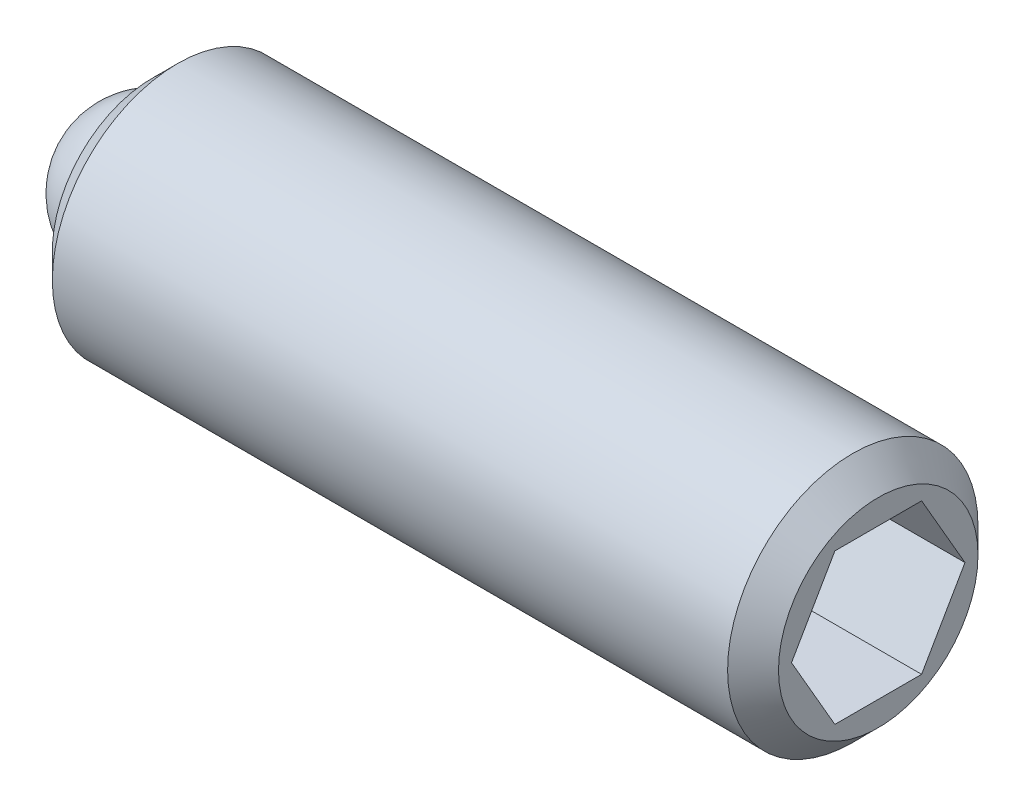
from build123d import *

# Parameters (mm, degrees)
SKETCH2_R           = 1.25
BOSS_EXTRUDE1_DEPTH = 7.25
CHAMFER1_SIZE       = 0.254
CHAMFER2_SIZE       = 0.254
CUT_EXTRUDE2_DEPTH  = 2
SKETCH3_R           = 0.75
CUT_EXTRUDE3_DEPTH  = 0.8


with BuildPart() as part:
    # Sketch2 → Boss-Extrude1 (new body)
    with BuildSketch(Plane(origin=(0, 0, 0), x_dir=(0, 0, -1), z_dir=(1, 0, 0))):
        with Locations(Location((0, 0, 0), (0, 0, 180))):
            Circle(SKETCH2_R)
    extrude(amount=BOSS_EXTRUDE1_DEPTH)

    # Chamfer1
    chamfer1_edges = [part.edges().sort_by_distance(p)[0] for p in [
        (0, 0, -1.25),
    ]]
    chamfer(chamfer1_edges, length=CHAMFER1_SIZE)

    # Chamfer2
    chamfer2_edges = [part.edges().sort_by_distance(p)[0] for p in [
        (7.25, 0, -1.25),
    ]]
    chamfer(chamfer2_edges, length=CHAMFER2_SIZE)

    # Sketch4 → Cut-Extrude2 (cut)
    with BuildSketch(Plane(origin=(7.25, 0, 0), x_dir=(0, 0, -1), z_dir=(1, 0, 0))):
        Polygon((0.866025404, 0), (0.433012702, 0.75), (-0.433012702, 0.75), (-0.866025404, 0), (-0.433012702, -0.75), (0.433012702, -0.75), align=None)
    extrude(amount=-CUT_EXTRUDE2_DEPTH, mode=Mode.SUBTRACT)

    # Sketch3 → Cut-Extrude3 (cut)
    with BuildSketch(Plane.ZY):
        Circle(SKETCH3_R)
    extrude(amount=-CUT_EXTRUDE3_DEPTH, mode=Mode.SUBTRACT)


with BuildPart() as body_2:
    # Sketch5 → Revolve1 (revolve)
    with BuildSketch(Plane.ZY):
        with BuildLine():
            Line((0, 0), (0, -0.75))
            ThreePointArc((0, -0.75), (-0.75, 0), (0, 0.75))
            Line((0, 0.75), (0, 0))
        make_face()
    revolve(axis=Axis((0, 0, 0), (0, 1, 0)))


solid = Compound([part.part, body_2.part])
